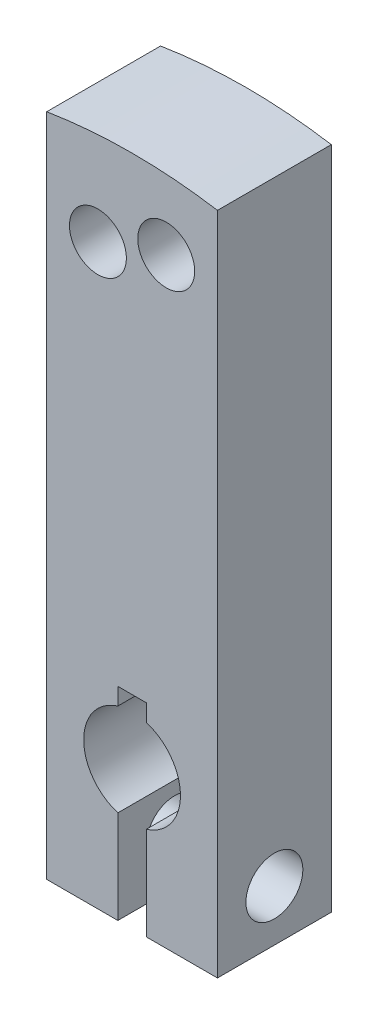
from build123d import *

# Parameters (mm, degrees)
BASE_EXTRUSION_DEPTH         = 20
ENL_V_MAT_EXTRU_1_DEPTH      = 20
ENL_V_MAT_EXTRU_1_DEPTH_BACK = 20
ESQUISSE2_R                  = 5
ESQUISSE3_R                  = 5
ENL_V_MAT_EXTRU_2_DEPTH      = 97.784554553


with BuildPart() as part:
    # Esquisse1 → Base-Extrusion (new body)
    with BuildSketch(Plane.XY):
        with BuildLine():
            Line((-15, 92.288948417), (-15, -24.5))
            Line((-15, -24.5), (-2.5, -24.5))
            Line((-2.5, -24.5), (-2.5, -8.124038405))
            ThreePointArc((-2.5, -8.124038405), (-8.5, 0), (-2.5, 8.124038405))
            Line((-2.5, 8.124038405), (-2.5, 11.124038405))
            Line((-2.5, 11.124038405), (2.5, 11.124038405))
            Line((2.5, 11.124038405), (2.5, 8.124038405))
            ThreePointArc((2.5, 8.124038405), (8.5, 0), (2.5, -8.124038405))
            Line((2.5, -8.124038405), (2.5, -24.5))
            Line((2.5, -24.5), (15, -24.5))
            Line((15, -24.5), (15, 92.288948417))
            ThreePointArc((15, 92.288948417), (0, 93.5), (-15, 92.288948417))
        make_face()
    extrude(amount=-BASE_EXTRUSION_DEPTH)

    # Esquisse2 → Enl_v. mat.-Extru.1 (cut, two sides: drawn at the far end of the back side and taken through both)
    with BuildSketch(Plane(origin=(0, 0, 0), x_dir=(0, 0, -1), z_dir=(1, 0, 0)).offset(-ENL_V_MAT_EXTRU_1_DEPTH_BACK)):
        with Locations(Location((10, -15.5, 0), (0, 0, 90))):
            Circle(ESQUISSE2_R)
    extrude(amount=ENL_V_MAT_EXTRU_1_DEPTH + ENL_V_MAT_EXTRU_1_DEPTH_BACK, mode=Mode.SUBTRACT)

    # Esquisse3 → Enl_v. mat.-Extru.2 (cut, through all)
    with BuildSketch(Plane.XY):
        with Locations((6, 81)):
            Circle(ESQUISSE3_R)
        with Locations((-6, 77)):
            Circle(ESQUISSE3_R)
    extrude(amount=-ENL_V_MAT_EXTRU_2_DEPTH, mode=Mode.SUBTRACT)


solid = part.part
